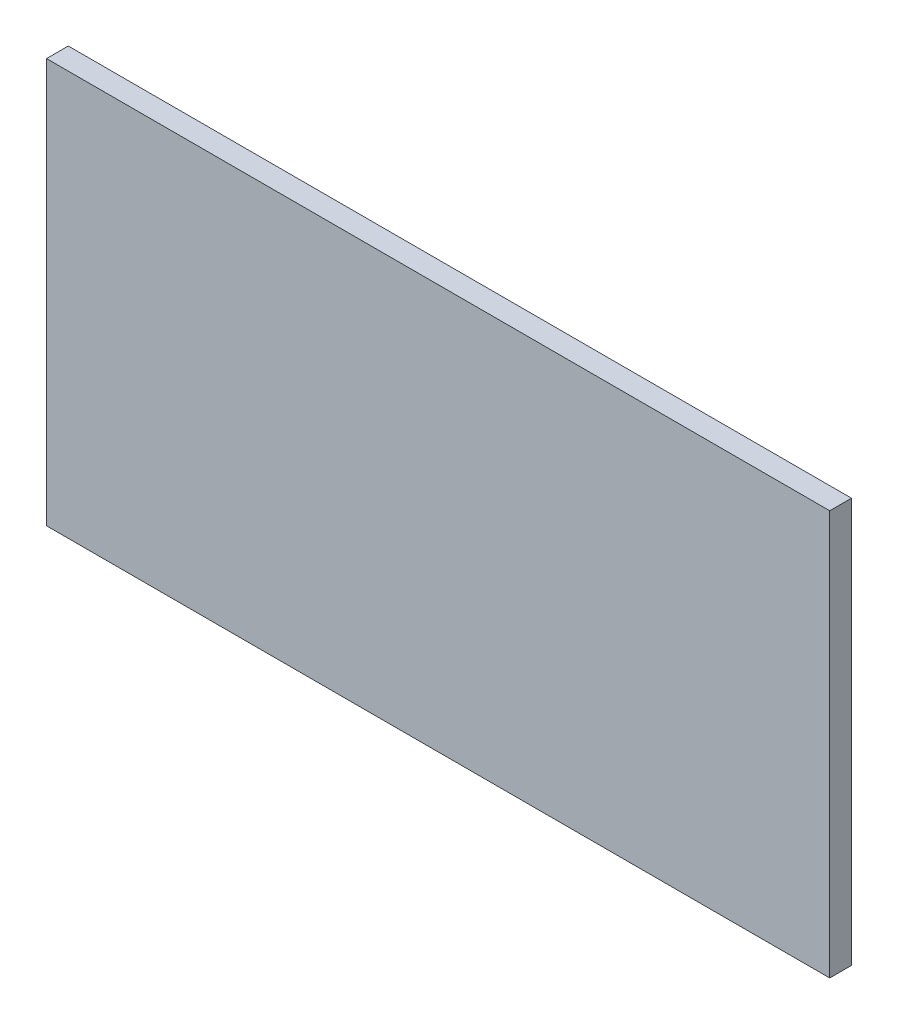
from build123d import *

# Parameters (mm, degrees)
ESQUISSE1_W      = 180
ESQUISSE1_H      = 93
EXTRUSION1_DEPTH = 5


with BuildPart() as part:
    # Esquisse1 → Extrusion1 (new body)
    with BuildSketch(Plane.XY):
        Rectangle(ESQUISSE1_W, ESQUISSE1_H)
    extrude(amount=EXTRUSION1_DEPTH)


solid = part.part
